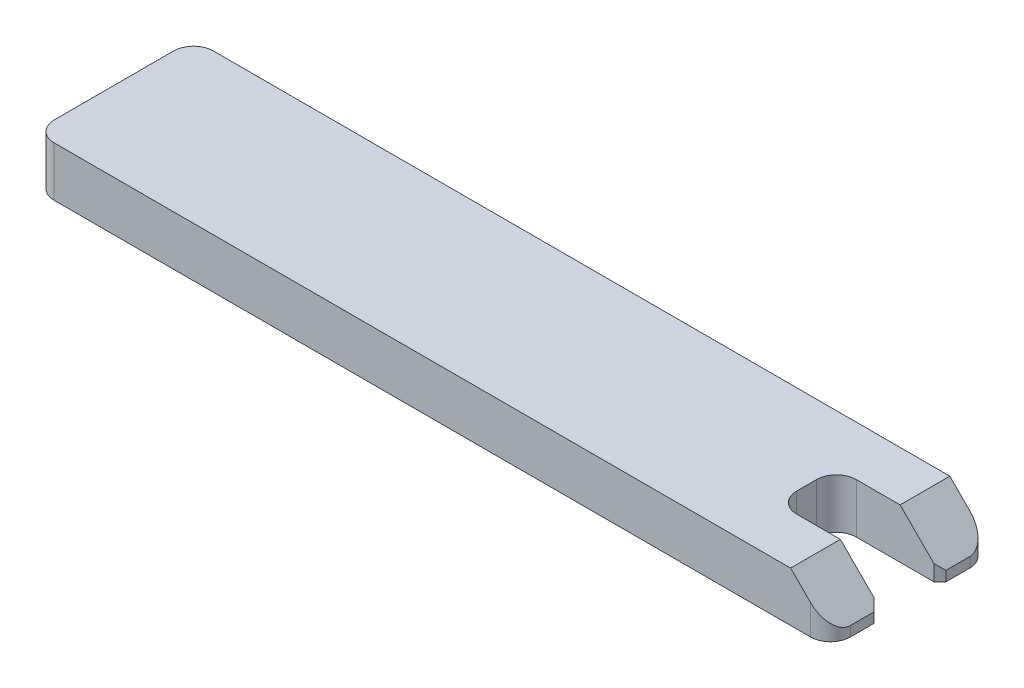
from build123d import *

# Parameters (mm, degrees)
BOSS_EXTRUDE1_DEPTH = 1.25
CHAMFER2_SIZE       = 2
FILLET1_R           = 1
CHAMFER1_SIZE       = 0.3


with BuildPart() as part:
    # Sketch1 → Boss-Extrude1 (new, symmetric)
    with BuildSketch(Plane(origin=(0, 0, 0), x_dir=(1, 0, 0), z_dir=(0, 1, 0))):
        Polygon((-2.6, 1.5), (2.6, 1.5), (2.6, 4), (-37.4, 4), (-37.4, -4), (2.6, -4), (2.6, -1.5), (-2.6, -1.5), align=None)
    extrude(amount=BOSS_EXTRUDE1_DEPTH, both=True)

    # Chamfer2
    chamfer2_edges = [part.edges().sort_by_distance(p)[0] for p in [
        (2.6, 1.25, -2.75),
        (2.6, 1.25, 2.75),
    ]]
    chamfer(chamfer2_edges, length=CHAMFER2_SIZE)

    # Fillet1
    fillet1_edges = [part.edges().sort_by_distance(p)[0] for p in [
        (-2.6, 0, 1.5),
        (-37.4, 0, 4),
        (-37.4, 0, -4),
        (-2.6, 0, -1.5),
        (2.6, -1, -4),
        (2.6, -1, 4),
    ]]
    fillet(fillet1_edges, radius=FILLET1_R)

    # Chamfer1
    chamfer1_edges = [part.edges().sort_by_distance(p)[0] for p in [
        (2.6, -1, -1.5),
        (2.6, -1, 1.5),
    ]]
    chamfer(chamfer1_edges, length=CHAMFER1_SIZE)


solid = part.part
